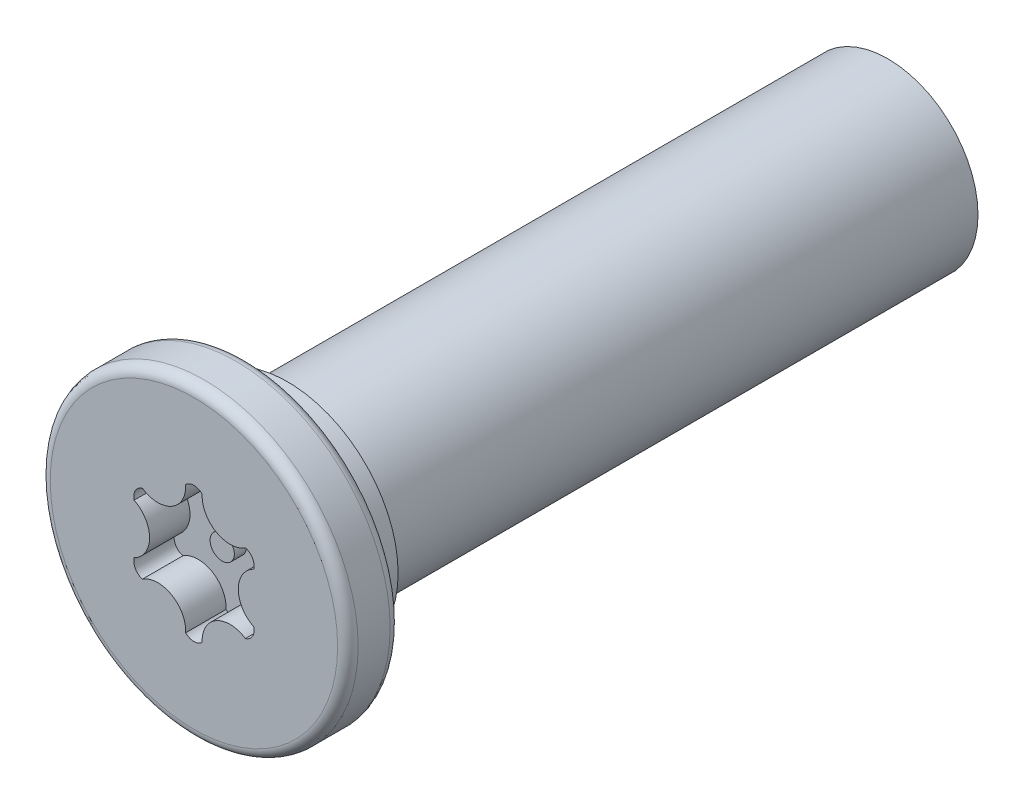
ISO-10303-21;
HEADER;
FILE_DESCRIPTION(('STEP AP214'),'2;1');
FILE_NAME('part.step','',(''),(''),'','','');
FILE_SCHEMA(('AUTOMOTIVE_DESIGN { 1 0 10303 214 1 1 1 1 }'));
ENDSEC;
DATA;
#1=APPLICATION_CONTEXT('core data for automotive mechanical design processes');
#2=APPLICATION_PROTOCOL_DEFINITION('international standard','automotive_design',2000,#1);
#3=PRODUCT_CONTEXT('',#1,'mechanical');
#4=PRODUCT('Part','Part','',(#3));
#5=PRODUCT_RELATED_PRODUCT_CATEGORY('part','',(#4));
#6=PRODUCT_DEFINITION_FORMATION('','',#4);
#7=PRODUCT_DEFINITION_CONTEXT('part definition',#1,'design');
#8=PRODUCT_DEFINITION('design','',#6,#7);
#9=PRODUCT_DEFINITION_SHAPE('','',#8);
#10=(LENGTH_UNIT() NAMED_UNIT(*) SI_UNIT(.MILLI.,.METRE.));
#11=(NAMED_UNIT(*) PLANE_ANGLE_UNIT() SI_UNIT($,.RADIAN.));
#12=(NAMED_UNIT(*) SI_UNIT($,.STERADIAN.) SOLID_ANGLE_UNIT());
#13=UNCERTAINTY_MEASURE_WITH_UNIT(LENGTH_MEASURE(1.E-05),#10,'distance_accuracy_value','');
#14=(GEOMETRIC_REPRESENTATION_CONTEXT(3) GLOBAL_UNCERTAINTY_ASSIGNED_CONTEXT((#13)) GLOBAL_UNIT_ASSIGNED_CONTEXT((#10,
#11,#12)) REPRESENTATION_CONTEXT('',''));
#15=CARTESIAN_POINT('',(0.,0.,0.));
#16=DIRECTION('',(0.,0.,1.));
#17=DIRECTION('',(1.,0.,0.));
#18=AXIS2_PLACEMENT_3D('',#15,#16,#17);
#19=CARTESIAN_POINT('',(0.,0.,0.));
#20=DIRECTION('',(0.,0.,1.));
#21=DIRECTION('',(1.,0.,0.));
#22=AXIS2_PLACEMENT_3D('',#19,#20,#21);
#23=PLANE('',#22);
#24=CARTESIAN_POINT('',(0.,0.,0.));
#25=DIRECTION('',(0.,0.,1.));
#26=DIRECTION('',(1.,0.,0.));
#27=AXIS2_PLACEMENT_3D('',#24,#25,#26);
#28=CIRCLE('',#27,3.55599999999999);
#29=CARTESIAN_POINT('',(3.55599999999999,0.,0.));
#30=VERTEX_POINT('',#29);
#31=EDGE_CURVE('E54',#30,#30,#28,.T.);
#32=ORIENTED_EDGE('',*,*,#31,.T.);
#33=EDGE_LOOP('',(#32));
#34=FACE_BOUND('',#33,.T.);
#35=CARTESIAN_POINT('',(0.893828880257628,1.54815703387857,0.));
#36=DIRECTION('',(0.,0.,1.));
#37=DIRECTION('',(1.,0.,0.));
#38=AXIS2_PLACEMENT_3D('',#35,#36,#37);
#39=CIRCLE('',#38,0.69);
#40=CARTESIAN_POINT('',(0.205060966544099,1.58937306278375,0.));
#41=VERTEX_POINT('',#40);
#42=CARTESIAN_POINT('',(1.27390696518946,0.972274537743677,0.));
#43=VERTEX_POINT('',#42);
#44=EDGE_CURVE('E181',#41,#43,#39,.T.);
#45=ORIENTED_EDGE('',*,*,#44,.T.);
#46=CARTESIAN_POINT('',(1.19884944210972,0.692156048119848,0.));
#47=DIRECTION('',(0.,0.,1.));
#48=DIRECTION('',(1.,0.,0.));
#49=AXIS2_PLACEMENT_3D('',#46,#47,#48);
#50=CIRCLE('',#49,0.29);
#51=CARTESIAN_POINT('',(1.47896793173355,0.617098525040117,0.));
#52=VERTEX_POINT('',#51);
#53=EDGE_CURVE('E61',#43,#52,#50,.F.);
#54=ORIENTED_EDGE('',*,*,#53,.T.);
#55=CARTESIAN_POINT('',(1.78765776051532,0.,0.));
#56=DIRECTION('',(0.,0.,1.));
#57=DIRECTION('',(1.,0.,0.));
#58=AXIS2_PLACEMENT_3D('',#55,#56,#57);
#59=CIRCLE('',#58,0.69);
#60=CARTESIAN_POINT('',(1.47896793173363,-0.617098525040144,0.));
#61=VERTEX_POINT('',#60);
#62=EDGE_CURVE('E111',#52,#61,#59,.T.);
#63=ORIENTED_EDGE('',*,*,#62,.T.);
#64=CARTESIAN_POINT('',(1.1988494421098,-0.692156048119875,0.));
#65=DIRECTION('',(0.,0.,1.));
#66=DIRECTION('',(1.,0.,0.));
#67=AXIS2_PLACEMENT_3D('',#64,#65,#66);
#68=CIRCLE('',#67,0.29);
#69=CARTESIAN_POINT('',(1.27390696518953,-0.972274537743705,0.));
#70=VERTEX_POINT('',#69);
#71=EDGE_CURVE('E216',#61,#70,#68,.F.);
#72=ORIENTED_EDGE('',*,*,#71,.T.);
#73=CARTESIAN_POINT('',(0.893828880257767,-1.54815703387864,0.));
#74=DIRECTION('',(0.,0.,1.));
#75=DIRECTION('',(1.,0.,0.));
#76=AXIS2_PLACEMENT_3D('',#73,#74,#75);
#77=CIRCLE('',#76,0.69);
#78=CARTESIAN_POINT('',(0.205060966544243,-1.5893730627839,0.));
#79=VERTEX_POINT('',#78);
#80=EDGE_CURVE('E160',#70,#79,#77,.T.);
#81=ORIENTED_EDGE('',*,*,#80,.T.);
#82=CARTESIAN_POINT('',(1.43067375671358E-13,-1.3843120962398,0.));
#83=DIRECTION('',(0.,0.,1.));
#84=DIRECTION('',(1.,0.,0.));
#85=AXIS2_PLACEMENT_3D('',#82,#83,#84);
#86=CIRCLE('',#85,0.29);
#87=CARTESIAN_POINT('',(-0.205060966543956,-1.5893730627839,0.));
#88=VERTEX_POINT('',#87);
#89=EDGE_CURVE('E210',#79,#88,#86,.F.);
#90=ORIENTED_EDGE('',*,*,#89,.T.);
#91=CARTESIAN_POINT('',(-0.893828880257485,-1.54815703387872,0.));
#92=DIRECTION('',(0.,0.,1.));
#93=DIRECTION('',(1.,0.,0.));
#94=AXIS2_PLACEMENT_3D('',#91,#92,#93);
#95=CIRCLE('',#94,0.69);
#96=CARTESIAN_POINT('',(-1.27390696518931,-0.97227453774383,0.));
#97=VERTEX_POINT('',#96);
#98=EDGE_CURVE('E206',#88,#97,#95,.T.);
#99=ORIENTED_EDGE('',*,*,#98,.T.);
#100=CARTESIAN_POINT('',(-1.19884944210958,-0.69215604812,0.));
#101=DIRECTION('',(0.,0.,1.));
#102=DIRECTION('',(1.,0.,0.));
#103=AXIS2_PLACEMENT_3D('',#100,#101,#102);
#104=CIRCLE('',#103,0.29);
#105=CARTESIAN_POINT('',(-1.47896793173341,-0.617098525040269,0.));
#106=VERTEX_POINT('',#105);
#107=EDGE_CURVE('E202',#97,#106,#104,.F.);
#108=ORIENTED_EDGE('',*,*,#107,.T.);
#109=CARTESIAN_POINT('',(-1.78765776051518,-1.56674837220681E-13,0.));
#110=DIRECTION('',(0.,0.,1.));
#111=DIRECTION('',(1.,0.,0.));
#112=AXIS2_PLACEMENT_3D('',#109,#110,#111);
#113=CIRCLE('',#112,0.69);
#114=CARTESIAN_POINT('',(-1.47896793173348,0.617098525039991,0.));
#115=VERTEX_POINT('',#114);
#116=EDGE_CURVE('E198',#106,#115,#113,.T.);
#117=ORIENTED_EDGE('',*,*,#116,.T.);
#118=CARTESIAN_POINT('',(-1.19884944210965,0.692156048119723,0.));
#119=DIRECTION('',(0.,0.,1.));
#120=DIRECTION('',(1.,0.,0.));
#121=AXIS2_PLACEMENT_3D('',#118,#119,#120);
#122=CIRCLE('',#121,0.29);
#123=CARTESIAN_POINT('',(-1.27390696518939,0.972274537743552,0.));
#124=VERTEX_POINT('',#123);
#125=EDGE_CURVE('E194',#115,#124,#122,.F.);
#126=ORIENTED_EDGE('',*,*,#125,.T.);
#127=CARTESIAN_POINT('',(-0.893828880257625,1.54815703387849,0.));
#128=DIRECTION('',(0.,0.,1.));
#129=DIRECTION('',(1.,0.,0.));
#130=AXIS2_PLACEMENT_3D('',#127,#128,#129);
#131=CIRCLE('',#130,0.690000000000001);
#132=CARTESIAN_POINT('',(-0.205060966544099,1.58937306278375,0.));
#133=VERTEX_POINT('',#132);
#134=EDGE_CURVE('E190',#124,#133,#131,.T.);
#135=ORIENTED_EDGE('',*,*,#134,.T.);
#136=CARTESIAN_POINT('',(0.,1.38431209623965,0.));
#137=DIRECTION('',(0.,0.,1.));
#138=DIRECTION('',(1.,0.,0.));
#139=AXIS2_PLACEMENT_3D('',#136,#137,#138);
#140=CIRCLE('',#139,0.29);
#141=EDGE_CURVE('E186',#133,#41,#140,.F.);
#142=ORIENTED_EDGE('',*,*,#141,.T.);
#143=EDGE_LOOP('',(#45,#54,#63,#72,#81,#90,#99,#108,#117,#126,#135,#142));
#144=FACE_BOUND('',#143,.T.);
#145=ADVANCED_FACE('F45',(#34,#144),#23,.T.);
#146=CARTESIAN_POINT('',(0.,0.,-1.3));
#147=DIRECTION('',(0.,0.,1.));
#148=DIRECTION('',(1.,0.,0.));
#149=AXIS2_PLACEMENT_3D('',#146,#147,#148);
#150=PLANE('',#149);
#151=CARTESIAN_POINT('',(0.,0.,-1.3));
#152=DIRECTION('',(0.,0.,1.));
#153=DIRECTION('',(1.,0.,0.));
#154=AXIS2_PLACEMENT_3D('',#151,#152,#153);
#155=CIRCLE('',#154,2.738000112);
#156=CARTESIAN_POINT('',(2.738000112,0.,-1.3));
#157=VERTEX_POINT('',#156);
#158=EDGE_CURVE('E11',#157,#157,#155,.F.);
#159=ORIENTED_EDGE('',*,*,#158,.F.);
#160=EDGE_LOOP('',(#159));
#161=FACE_BOUND('',#160,.T.);
#162=CARTESIAN_POINT('',(0.,0.,-1.3));
#163=DIRECTION('',(0.,0.,1.));
#164=DIRECTION('',(1.,0.,0.));
#165=AXIS2_PLACEMENT_3D('',#162,#163,#164);
#166=CIRCLE('',#165,3.55599999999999);
#167=CARTESIAN_POINT('',(3.55599999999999,0.,-1.3));
#168=VERTEX_POINT('',#167);
#169=EDGE_CURVE('E260',#168,#168,#166,.F.);
#170=ORIENTED_EDGE('',*,*,#169,.T.);
#171=EDGE_LOOP('',(#170));
#172=FACE_BOUND('',#171,.T.);
#173=ADVANCED_FACE('F283',(#161,#172),#150,.F.);
#174=CARTESIAN_POINT('',(0.,0.,-1.3));
#175=DIRECTION('',(0.,0.,1.));
#176=DIRECTION('',(1.,0.,0.));
#177=AXIS2_PLACEMENT_3D('',#174,#175,#176);
#178=CYLINDRICAL_SURFACE('',#177,3.80999999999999);
#179=CARTESIAN_POINT('',(0.,0.,-1.046));
#180=DIRECTION('',(0.,0.,1.));
#181=DIRECTION('',(1.,0.,0.));
#182=AXIS2_PLACEMENT_3D('',#179,#180,#181);
#183=CIRCLE('',#182,3.80999999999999);
#184=CARTESIAN_POINT('',(3.80999999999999,0.,-1.046));
#185=VERTEX_POINT('',#184);
#186=EDGE_CURVE('E256',#185,#185,#183,.T.);
#187=ORIENTED_EDGE('',*,*,#186,.T.);
#188=EDGE_LOOP('',(#187));
#189=FACE_BOUND('',#188,.T.);
#190=CARTESIAN_POINT('',(0.,0.,-0.254));
#191=DIRECTION('',(0.,0.,1.));
#192=DIRECTION('',(1.,0.,0.));
#193=AXIS2_PLACEMENT_3D('',#190,#191,#192);
#194=CIRCLE('',#193,3.80999999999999);
#195=CARTESIAN_POINT('',(3.80999999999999,0.,-0.254));
#196=VERTEX_POINT('',#195);
#197=EDGE_CURVE('E225',#196,#196,#194,.F.);
#198=ORIENTED_EDGE('',*,*,#197,.T.);
#199=EDGE_LOOP('',(#198));
#200=FACE_BOUND('',#199,.T.);
#201=ADVANCED_FACE('F289',(#189,#200),#178,.T.);
#202=CARTESIAN_POINT('',(1.19884944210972,0.692156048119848,-1.));
#203=DIRECTION('',(0.,0.,1.));
#204=DIRECTION('',(1.,0.,0.));
#205=AXIS2_PLACEMENT_3D('',#202,#203,#204);
#206=CYLINDRICAL_SURFACE('',#205,0.29);
#207=ORIENTED_EDGE('',*,*,#53,.F.);
#208=DIRECTION('',(0.,0.,1.));
#209=VECTOR('',#208,1.);
#210=CARTESIAN_POINT('',(1.27390696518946,0.972274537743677,-1.));
#211=LINE('',#210,#209);
#212=CARTESIAN_POINT('',(1.27390696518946,0.972274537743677,-1.));
#213=VERTEX_POINT('',#212);
#214=EDGE_CURVE('E178',#213,#43,#211,.T.);
#215=ORIENTED_EDGE('',*,*,#214,.F.);
#216=CARTESIAN_POINT('',(1.19884944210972,0.692156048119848,-1.));
#217=DIRECTION('',(0.,0.,1.));
#218=DIRECTION('',(1.,0.,0.));
#219=AXIS2_PLACEMENT_3D('',#216,#217,#218);
#220=CIRCLE('',#219,0.29);
#221=CARTESIAN_POINT('',(1.47896793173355,0.617098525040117,-1.));
#222=VERTEX_POINT('',#221);
#223=EDGE_CURVE('E221',#213,#222,#220,.F.);
#224=ORIENTED_EDGE('',*,*,#223,.T.);
#225=DIRECTION('',(0.,0.,1.));
#226=VECTOR('',#225,1.);
#227=CARTESIAN_POINT('',(1.47896793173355,0.617098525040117,-1.));
#228=LINE('',#227,#226);
#229=EDGE_CURVE('E222',#222,#52,#228,.T.);
#230=ORIENTED_EDGE('',*,*,#229,.T.);
#231=EDGE_LOOP('',(#207,#215,#224,#230));
#232=FACE_BOUND('',#231,.T.);
#233=ADVANCED_FACE('F294',(#232),#206,.F.);
#234=CARTESIAN_POINT('',(1.78765776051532,0.,-1.));
#235=DIRECTION('',(0.,0.,1.));
#236=DIRECTION('',(1.,0.,0.));
#237=AXIS2_PLACEMENT_3D('',#234,#235,#236);
#238=CYLINDRICAL_SURFACE('',#237,0.69);
#239=ORIENTED_EDGE('',*,*,#62,.F.);
#240=ORIENTED_EDGE('',*,*,#229,.F.);
#241=CARTESIAN_POINT('',(1.78765776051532,0.,-1.));
#242=DIRECTION('',(0.,0.,1.));
#243=DIRECTION('',(1.,0.,0.));
#244=AXIS2_PLACEMENT_3D('',#241,#242,#243);
#245=CIRCLE('',#244,0.69);
#246=CARTESIAN_POINT('',(1.47896793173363,-0.617098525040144,-1.));
#247=VERTEX_POINT('',#246);
#248=EDGE_CURVE('E70',#222,#247,#245,.T.);
#249=ORIENTED_EDGE('',*,*,#248,.T.);
#250=DIRECTION('',(0.,0.,1.));
#251=VECTOR('',#250,1.);
#252=CARTESIAN_POINT('',(1.47896793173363,-0.617098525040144,-1.));
#253=LINE('',#252,#251);
#254=EDGE_CURVE('E151',#247,#61,#253,.T.);
#255=ORIENTED_EDGE('',*,*,#254,.T.);
#256=EDGE_LOOP('',(#239,#240,#249,#255));
#257=FACE_BOUND('',#256,.T.);
#258=ADVANCED_FACE('F301',(#257),#238,.T.);
#259=CARTESIAN_POINT('',(1.1988494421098,-0.692156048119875,-1.));
#260=DIRECTION('',(0.,0.,1.));
#261=DIRECTION('',(1.,0.,0.));
#262=AXIS2_PLACEMENT_3D('',#259,#260,#261);
#263=CYLINDRICAL_SURFACE('',#262,0.29);
#264=ORIENTED_EDGE('',*,*,#71,.F.);
#265=ORIENTED_EDGE('',*,*,#254,.F.);
#266=CARTESIAN_POINT('',(1.1988494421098,-0.692156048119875,-1.));
#267=DIRECTION('',(0.,0.,1.));
#268=DIRECTION('',(1.,0.,0.));
#269=AXIS2_PLACEMENT_3D('',#266,#267,#268);
#270=CIRCLE('',#269,0.29);
#271=CARTESIAN_POINT('',(1.27390696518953,-0.972274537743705,-1.));
#272=VERTEX_POINT('',#271);
#273=EDGE_CURVE('E145',#247,#272,#270,.F.);
#274=ORIENTED_EDGE('',*,*,#273,.T.);
#275=DIRECTION('',(0.,0.,1.));
#276=VECTOR('',#275,1.);
#277=CARTESIAN_POINT('',(1.27390696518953,-0.972274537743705,-1.));
#278=LINE('',#277,#276);
#279=EDGE_CURVE('E149',#272,#70,#278,.T.);
#280=ORIENTED_EDGE('',*,*,#279,.T.);
#281=EDGE_LOOP('',(#264,#265,#274,#280));
#282=FACE_BOUND('',#281,.T.);
#283=ADVANCED_FACE('F148',(#282),#263,.F.);
#284=CARTESIAN_POINT('',(0.893828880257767,-1.54815703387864,-1.));
#285=DIRECTION('',(0.,0.,1.));
#286=DIRECTION('',(1.,0.,0.));
#287=AXIS2_PLACEMENT_3D('',#284,#285,#286);
#288=CYLINDRICAL_SURFACE('',#287,0.69);
#289=ORIENTED_EDGE('',*,*,#80,.F.);
#290=ORIENTED_EDGE('',*,*,#279,.F.);
#291=CARTESIAN_POINT('',(0.893828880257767,-1.54815703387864,-1.));
#292=DIRECTION('',(0.,0.,1.));
#293=DIRECTION('',(1.,0.,0.));
#294=AXIS2_PLACEMENT_3D('',#291,#292,#293);
#295=CIRCLE('',#294,0.69);
#296=CARTESIAN_POINT('',(0.205060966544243,-1.5893730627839,-1.));
#297=VERTEX_POINT('',#296);
#298=EDGE_CURVE('E154',#272,#297,#295,.T.);
#299=ORIENTED_EDGE('',*,*,#298,.T.);
#300=DIRECTION('',(0.,0.,1.));
#301=VECTOR('',#300,1.);
#302=CARTESIAN_POINT('',(0.205060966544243,-1.5893730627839,-1.));
#303=LINE('',#302,#301);
#304=EDGE_CURVE('E163',#297,#79,#303,.T.);
#305=ORIENTED_EDGE('',*,*,#304,.T.);
#306=EDGE_LOOP('',(#289,#290,#299,#305));
#307=FACE_BOUND('',#306,.T.);
#308=ADVANCED_FACE('F157',(#307),#288,.T.);
#309=CARTESIAN_POINT('',(1.43067375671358E-13,-1.3843120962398,-1.));
#310=DIRECTION('',(0.,0.,1.));
#311=DIRECTION('',(1.,0.,0.));
#312=AXIS2_PLACEMENT_3D('',#309,#310,#311);
#313=CYLINDRICAL_SURFACE('',#312,0.29);
#314=ORIENTED_EDGE('',*,*,#89,.F.);
#315=ORIENTED_EDGE('',*,*,#304,.F.);
#316=CARTESIAN_POINT('',(1.43067375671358E-13,-1.3843120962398,-1.));
#317=DIRECTION('',(0.,0.,1.));
#318=DIRECTION('',(1.,0.,0.));
#319=AXIS2_PLACEMENT_3D('',#316,#317,#318);
#320=CIRCLE('',#319,0.29);
#321=CARTESIAN_POINT('',(-0.205060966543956,-1.5893730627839,-1.));
#322=VERTEX_POINT('',#321);
#323=EDGE_CURVE('E168',#297,#322,#320,.F.);
#324=ORIENTED_EDGE('',*,*,#323,.T.);
#325=DIRECTION('',(0.,0.,1.));
#326=VECTOR('',#325,1.);
#327=CARTESIAN_POINT('',(-0.205060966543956,-1.5893730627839,-1.));
#328=LINE('',#327,#326);
#329=EDGE_CURVE('E230',#322,#88,#328,.T.);
#330=ORIENTED_EDGE('',*,*,#329,.T.);
#331=EDGE_LOOP('',(#314,#315,#324,#330));
#332=FACE_BOUND('',#331,.T.);
#333=ADVANCED_FACE('F318',(#332),#313,.F.);
#334=CARTESIAN_POINT('',(-0.893828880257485,-1.54815703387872,-1.));
#335=DIRECTION('',(0.,0.,1.));
#336=DIRECTION('',(1.,0.,0.));
#337=AXIS2_PLACEMENT_3D('',#334,#335,#336);
#338=CYLINDRICAL_SURFACE('',#337,0.69);
#339=ORIENTED_EDGE('',*,*,#98,.F.);
#340=ORIENTED_EDGE('',*,*,#329,.F.);
#341=CARTESIAN_POINT('',(-0.893828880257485,-1.54815703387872,-1.));
#342=DIRECTION('',(0.,0.,1.));
#343=DIRECTION('',(1.,0.,0.));
#344=AXIS2_PLACEMENT_3D('',#341,#342,#343);
#345=CIRCLE('',#344,0.69);
#346=CARTESIAN_POINT('',(-1.27390696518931,-0.97227453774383,-1.));
#347=VERTEX_POINT('',#346);
#348=EDGE_CURVE('E172',#322,#347,#345,.T.);
#349=ORIENTED_EDGE('',*,*,#348,.T.);
#350=DIRECTION('',(0.,0.,1.));
#351=VECTOR('',#350,1.);
#352=CARTESIAN_POINT('',(-1.27390696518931,-0.97227453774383,-1.));
#353=LINE('',#352,#351);
#354=EDGE_CURVE('E233',#347,#97,#353,.T.);
#355=ORIENTED_EDGE('',*,*,#354,.T.);
#356=EDGE_LOOP('',(#339,#340,#349,#355));
#357=FACE_BOUND('',#356,.T.);
#358=ADVANCED_FACE('F321',(#357),#338,.T.);
#359=CARTESIAN_POINT('',(-1.19884944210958,-0.69215604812,-1.));
#360=DIRECTION('',(0.,0.,1.));
#361=DIRECTION('',(1.,0.,0.));
#362=AXIS2_PLACEMENT_3D('',#359,#360,#361);
#363=CYLINDRICAL_SURFACE('',#362,0.29);
#364=ORIENTED_EDGE('',*,*,#107,.F.);
#365=ORIENTED_EDGE('',*,*,#354,.F.);
#366=CARTESIAN_POINT('',(-1.19884944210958,-0.69215604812,-1.));
#367=DIRECTION('',(0.,0.,1.));
#368=DIRECTION('',(1.,0.,0.));
#369=AXIS2_PLACEMENT_3D('',#366,#367,#368);
#370=CIRCLE('',#369,0.29);
#371=CARTESIAN_POINT('',(-1.47896793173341,-0.617098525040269,-1.));
#372=VERTEX_POINT('',#371);
#373=EDGE_CURVE('E374',#347,#372,#370,.F.);
#374=ORIENTED_EDGE('',*,*,#373,.T.);
#375=DIRECTION('',(0.,0.,1.));
#376=VECTOR('',#375,1.);
#377=CARTESIAN_POINT('',(-1.47896793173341,-0.617098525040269,-1.));
#378=LINE('',#377,#376);
#379=EDGE_CURVE('E236',#372,#106,#378,.T.);
#380=ORIENTED_EDGE('',*,*,#379,.T.);
#381=EDGE_LOOP('',(#364,#365,#374,#380));
#382=FACE_BOUND('',#381,.T.);
#383=ADVANCED_FACE('F325',(#382),#363,.F.);
#384=CARTESIAN_POINT('',(-1.78765776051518,-1.56674837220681E-13,-1.));
#385=DIRECTION('',(0.,0.,1.));
#386=DIRECTION('',(1.,0.,0.));
#387=AXIS2_PLACEMENT_3D('',#384,#385,#386);
#388=CYLINDRICAL_SURFACE('',#387,0.69);
#389=ORIENTED_EDGE('',*,*,#116,.F.);
#390=ORIENTED_EDGE('',*,*,#379,.F.);
#391=CARTESIAN_POINT('',(-1.78765776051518,-1.56674837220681E-13,-1.));
#392=DIRECTION('',(0.,0.,1.));
#393=DIRECTION('',(1.,0.,0.));
#394=AXIS2_PLACEMENT_3D('',#391,#392,#393);
#395=CIRCLE('',#394,0.69);
#396=CARTESIAN_POINT('',(-1.47896793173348,0.617098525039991,-1.));
#397=VERTEX_POINT('',#396);
#398=EDGE_CURVE('E371',#372,#397,#395,.T.);
#399=ORIENTED_EDGE('',*,*,#398,.T.);
#400=DIRECTION('',(0.,0.,1.));
#401=VECTOR('',#400,1.);
#402=CARTESIAN_POINT('',(-1.47896793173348,0.617098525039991,-1.));
#403=LINE('',#402,#401);
#404=EDGE_CURVE('E239',#397,#115,#403,.T.);
#405=ORIENTED_EDGE('',*,*,#404,.T.);
#406=EDGE_LOOP('',(#389,#390,#399,#405));
#407=FACE_BOUND('',#406,.T.);
#408=ADVANCED_FACE('F329',(#407),#388,.T.);
#409=CARTESIAN_POINT('',(-1.19884944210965,0.692156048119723,-1.));
#410=DIRECTION('',(0.,0.,1.));
#411=DIRECTION('',(1.,0.,0.));
#412=AXIS2_PLACEMENT_3D('',#409,#410,#411);
#413=CYLINDRICAL_SURFACE('',#412,0.29);
#414=ORIENTED_EDGE('',*,*,#125,.F.);
#415=ORIENTED_EDGE('',*,*,#404,.F.);
#416=CARTESIAN_POINT('',(-1.19884944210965,0.692156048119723,-1.));
#417=DIRECTION('',(0.,0.,1.));
#418=DIRECTION('',(1.,0.,0.));
#419=AXIS2_PLACEMENT_3D('',#416,#417,#418);
#420=CIRCLE('',#419,0.29);
#421=CARTESIAN_POINT('',(-1.27390696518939,0.972274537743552,-1.));
#422=VERTEX_POINT('',#421);
#423=EDGE_CURVE('E364',#397,#422,#420,.F.);
#424=ORIENTED_EDGE('',*,*,#423,.T.);
#425=DIRECTION('',(0.,0.,1.));
#426=VECTOR('',#425,1.);
#427=CARTESIAN_POINT('',(-1.27390696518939,0.972274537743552,-1.));
#428=LINE('',#427,#426);
#429=EDGE_CURVE('E242',#422,#124,#428,.T.);
#430=ORIENTED_EDGE('',*,*,#429,.T.);
#431=EDGE_LOOP('',(#414,#415,#424,#430));
#432=FACE_BOUND('',#431,.T.);
#433=ADVANCED_FACE('F333',(#432),#413,.F.);
#434=CARTESIAN_POINT('',(-0.893828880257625,1.54815703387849,-1.));
#435=DIRECTION('',(0.,0.,1.));
#436=DIRECTION('',(1.,0.,0.));
#437=AXIS2_PLACEMENT_3D('',#434,#435,#436);
#438=CYLINDRICAL_SURFACE('',#437,0.690000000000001);
#439=ORIENTED_EDGE('',*,*,#134,.F.);
#440=ORIENTED_EDGE('',*,*,#429,.F.);
#441=CARTESIAN_POINT('',(-0.893828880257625,1.54815703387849,-1.));
#442=DIRECTION('',(0.,0.,1.));
#443=DIRECTION('',(1.,0.,0.));
#444=AXIS2_PLACEMENT_3D('',#441,#442,#443);
#445=CIRCLE('',#444,0.690000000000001);
#446=CARTESIAN_POINT('',(-0.205060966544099,1.58937306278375,-1.));
#447=VERTEX_POINT('',#446);
#448=EDGE_CURVE('E360',#422,#447,#445,.T.);
#449=ORIENTED_EDGE('',*,*,#448,.T.);
#450=DIRECTION('',(0.,0.,1.));
#451=VECTOR('',#450,1.);
#452=CARTESIAN_POINT('',(-0.205060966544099,1.58937306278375,-1.));
#453=LINE('',#452,#451);
#454=EDGE_CURVE('E245',#447,#133,#453,.T.);
#455=ORIENTED_EDGE('',*,*,#454,.T.);
#456=EDGE_LOOP('',(#439,#440,#449,#455));
#457=FACE_BOUND('',#456,.T.);
#458=ADVANCED_FACE('F337',(#457),#438,.T.);
#459=CARTESIAN_POINT('',(0.,1.38431209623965,-1.));
#460=DIRECTION('',(0.,0.,1.));
#461=DIRECTION('',(1.,0.,0.));
#462=AXIS2_PLACEMENT_3D('',#459,#460,#461);
#463=CYLINDRICAL_SURFACE('',#462,0.29);
#464=ORIENTED_EDGE('',*,*,#141,.F.);
#465=ORIENTED_EDGE('',*,*,#454,.F.);
#466=CARTESIAN_POINT('',(0.,1.38431209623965,-1.));
#467=DIRECTION('',(0.,0.,1.));
#468=DIRECTION('',(1.,0.,0.));
#469=AXIS2_PLACEMENT_3D('',#466,#467,#468);
#470=CIRCLE('',#469,0.29);
#471=CARTESIAN_POINT('',(0.205060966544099,1.58937306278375,-1.));
#472=VERTEX_POINT('',#471);
#473=EDGE_CURVE('E357',#447,#472,#470,.F.);
#474=ORIENTED_EDGE('',*,*,#473,.T.);
#475=DIRECTION('',(0.,0.,1.));
#476=VECTOR('',#475,1.);
#477=CARTESIAN_POINT('',(0.205060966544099,1.58937306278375,-1.));
#478=LINE('',#477,#476);
#479=EDGE_CURVE('E248',#472,#41,#478,.T.);
#480=ORIENTED_EDGE('',*,*,#479,.T.);
#481=EDGE_LOOP('',(#464,#465,#474,#480));
#482=FACE_BOUND('',#481,.T.);
#483=ADVANCED_FACE('F341',(#482),#463,.F.);
#484=CARTESIAN_POINT('',(0.893828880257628,1.54815703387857,-1.));
#485=DIRECTION('',(0.,0.,1.));
#486=DIRECTION('',(1.,0.,0.));
#487=AXIS2_PLACEMENT_3D('',#484,#485,#486);
#488=CYLINDRICAL_SURFACE('',#487,0.69);
#489=ORIENTED_EDGE('',*,*,#44,.F.);
#490=ORIENTED_EDGE('',*,*,#479,.F.);
#491=CARTESIAN_POINT('',(0.893828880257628,1.54815703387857,-1.));
#492=DIRECTION('',(0.,0.,1.));
#493=DIRECTION('',(1.,0.,0.));
#494=AXIS2_PLACEMENT_3D('',#491,#492,#493);
#495=CIRCLE('',#494,0.69);
#496=EDGE_CURVE('E118',#472,#213,#495,.T.);
#497=ORIENTED_EDGE('',*,*,#496,.T.);
#498=ORIENTED_EDGE('',*,*,#214,.T.);
#499=EDGE_LOOP('',(#489,#490,#497,#498));
#500=FACE_BOUND('',#499,.T.);
#501=ADVANCED_FACE('F344',(#500),#488,.T.);
#502=CARTESIAN_POINT('',(0.,0.,-1.));
#503=DIRECTION('',(0.,0.,1.));
#504=DIRECTION('',(1.,0.,0.));
#505=AXIS2_PLACEMENT_3D('',#502,#503,#504);
#506=PLANE('',#505);
#507=CARTESIAN_POINT('',(0.,0.,-1.));
#508=DIRECTION('',(0.,0.,1.));
#509=DIRECTION('',(1.,0.,0.));
#510=AXIS2_PLACEMENT_3D('',#507,#508,#509);
#511=CIRCLE('',#510,0.3);
#512=CARTESIAN_POINT('',(0.3,0.,-1.));
#513=VERTEX_POINT('',#512);
#514=EDGE_CURVE('E396',#513,#513,#511,.T.);
#515=ORIENTED_EDGE('',*,*,#514,.F.);
#516=EDGE_LOOP('',(#515));
#517=FACE_BOUND('',#516,.T.);
#518=ORIENTED_EDGE('',*,*,#223,.F.);
#519=ORIENTED_EDGE('',*,*,#496,.F.);
#520=ORIENTED_EDGE('',*,*,#473,.F.);
#521=ORIENTED_EDGE('',*,*,#448,.F.);
#522=ORIENTED_EDGE('',*,*,#423,.F.);
#523=ORIENTED_EDGE('',*,*,#398,.F.);
#524=ORIENTED_EDGE('',*,*,#373,.F.);
#525=ORIENTED_EDGE('',*,*,#348,.F.);
#526=ORIENTED_EDGE('',*,*,#323,.F.);
#527=ORIENTED_EDGE('',*,*,#298,.F.);
#528=ORIENTED_EDGE('',*,*,#273,.F.);
#529=ORIENTED_EDGE('',*,*,#248,.F.);
#530=EDGE_LOOP('',(#518,#519,#520,#521,#522,#523,#524,#525,#526,#527,#528,#529));
#531=FACE_BOUND('',#530,.T.);
#532=ADVANCED_FACE('F166',(#517,#531),#506,.T.);
#533=CARTESIAN_POINT('',(0.,0.,-1.046));
#534=DIRECTION('',(0.,0.,1.));
#535=DIRECTION('',(1.,0.,0.));
#536=AXIS2_PLACEMENT_3D('',#533,#534,#535);
#537=TOROIDAL_SURFACE('',#536,3.55599999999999,0.254);
#538=ORIENTED_EDGE('',*,*,#169,.F.);
#539=EDGE_LOOP('',(#538));
#540=FACE_BOUND('',#539,.T.);
#541=ORIENTED_EDGE('',*,*,#186,.F.);
#542=EDGE_LOOP('',(#541));
#543=FACE_BOUND('',#542,.T.);
#544=ADVANCED_FACE('F271',(#540,#543),#537,.T.);
#545=CARTESIAN_POINT('',(0.,0.,-0.254));
#546=DIRECTION('',(0.,0.,1.));
#547=DIRECTION('',(1.,0.,0.));
#548=AXIS2_PLACEMENT_3D('',#545,#546,#547);
#549=TOROIDAL_SURFACE('',#548,3.55599999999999,0.254);
#550=ORIENTED_EDGE('',*,*,#197,.F.);
#551=EDGE_LOOP('',(#550));
#552=FACE_BOUND('',#551,.T.);
#553=ORIENTED_EDGE('',*,*,#31,.F.);
#554=EDGE_LOOP('',(#553));
#555=FACE_BOUND('',#554,.T.);
#556=ADVANCED_FACE('F47',(#552,#555),#549,.T.);
#557=CARTESIAN_POINT('',(0.,0.,-2.316));
#558=DIRECTION('',(0.,0.,-1.));
#559=DIRECTION('',(-1.,0.,0.));
#560=AXIS2_PLACEMENT_3D('',#557,#558,#559);
#561=PLANE('',#560);
#562=CARTESIAN_POINT('',(0.,0.,-2.316));
#563=DIRECTION('',(0.,0.,-1.));
#564=DIRECTION('',(-1.,0.,0.));
#565=AXIS2_PLACEMENT_3D('',#562,#563,#564);
#566=CIRCLE('',#565,2.738000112);
#567=CARTESIAN_POINT('',(-2.738000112,0.,-2.316));
#568=VERTEX_POINT('',#567);
#569=EDGE_CURVE('E182',#568,#568,#566,.T.);
#570=ORIENTED_EDGE('',*,*,#569,.T.);
#571=EDGE_LOOP('',(#570));
#572=FACE_BOUND('',#571,.T.);
#573=CARTESIAN_POINT('',(0.,0.,-2.316));
#574=DIRECTION('',(0.,0.,-1.));
#575=DIRECTION('',(-1.,0.,0.));
#576=AXIS2_PLACEMENT_3D('',#573,#574,#575);
#577=CIRCLE('',#576,2.230000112);
#578=CARTESIAN_POINT('',(-2.230000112,0.,-2.316));
#579=VERTEX_POINT('',#578);
#580=EDGE_CURVE('E400',#579,#579,#577,.T.);
#581=ORIENTED_EDGE('',*,*,#580,.F.);
#582=EDGE_LOOP('',(#581));
#583=FACE_BOUND('',#582,.T.);
#584=ADVANCED_FACE('F270',(#572,#583),#561,.T.);
#585=CARTESIAN_POINT('',(0.,0.,-2.316));
#586=DIRECTION('',(0.,0.,1.));
#587=DIRECTION('',(1.,0.,0.));
#588=AXIS2_PLACEMENT_3D('',#585,#586,#587);
#589=CYLINDRICAL_SURFACE('',#588,2.738000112);
#590=ORIENTED_EDGE('',*,*,#569,.F.);
#591=EDGE_LOOP('',(#590));
#592=FACE_BOUND('',#591,.T.);
#593=ORIENTED_EDGE('',*,*,#158,.T.);
#594=EDGE_LOOP('',(#593));
#595=FACE_BOUND('',#594,.T.);
#596=ADVANCED_FACE('F277',(#592,#595),#589,.T.);
#597=CARTESIAN_POINT('',(0.,0.,-0.7));
#598=DIRECTION('',(0.,0.,-1.));
#599=DIRECTION('',(-1.,0.,0.));
#600=AXIS2_PLACEMENT_3D('',#597,#598,#599);
#601=CYLINDRICAL_SURFACE('',#600,0.3);
#602=CARTESIAN_POINT('',(0.,0.,-0.7));
#603=DIRECTION('',(0.,0.,1.));
#604=DIRECTION('',(1.,0.,0.));
#605=AXIS2_PLACEMENT_3D('',#602,#603,#604);
#606=CIRCLE('',#605,0.3);
#607=CARTESIAN_POINT('',(0.3,0.,-0.7));
#608=VERTEX_POINT('',#607);
#609=EDGE_CURVE('E395',#608,#608,#606,.T.);
#610=ORIENTED_EDGE('',*,*,#609,.F.);
#611=EDGE_LOOP('',(#610));
#612=FACE_BOUND('',#611,.T.);
#613=ORIENTED_EDGE('',*,*,#514,.T.);
#614=EDGE_LOOP('',(#613));
#615=FACE_BOUND('',#614,.T.);
#616=ADVANCED_FACE('F424',(#612,#615),#601,.T.);
#617=CARTESIAN_POINT('',(0.,0.,-0.7));
#618=DIRECTION('',(0.,0.,1.));
#619=DIRECTION('',(1.,0.,0.));
#620=AXIS2_PLACEMENT_3D('',#617,#618,#619);
#621=PLANE('',#620);
#622=ORIENTED_EDGE('',*,*,#609,.T.);
#623=EDGE_LOOP('',(#622));
#624=FACE_BOUND('',#623,.T.);
#625=ADVANCED_FACE('F416',(#624),#621,.T.);
#626=CARTESIAN_POINT('',(0.,0.,-17.175));
#627=DIRECTION('',(0.,0.,1.));
#628=DIRECTION('',(1.,0.,0.));
#629=AXIS2_PLACEMENT_3D('',#626,#627,#628);
#630=CYLINDRICAL_SURFACE('',#629,2.230000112);
#631=ORIENTED_EDGE('',*,*,#580,.T.);
#632=EDGE_LOOP('',(#631));
#633=FACE_BOUND('',#632,.T.);
#634=CARTESIAN_POINT('',(0.,0.,-17.175));
#635=DIRECTION('',(0.,0.,-1.));
#636=DIRECTION('',(-1.,0.,0.));
#637=AXIS2_PLACEMENT_3D('',#634,#635,#636);
#638=CIRCLE('',#637,2.230000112);
#639=CARTESIAN_POINT('',(-2.230000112,0.,-17.175));
#640=VERTEX_POINT('',#639);
#641=EDGE_CURVE('E407',#640,#640,#638,.T.);
#642=ORIENTED_EDGE('',*,*,#641,.F.);
#643=EDGE_LOOP('',(#642));
#644=FACE_BOUND('',#643,.T.);
#645=ADVANCED_FACE('F414',(#633,#644),#630,.T.);
#646=CARTESIAN_POINT('',(0.,0.,-17.175));
#647=DIRECTION('',(0.,0.,-1.));
#648=DIRECTION('',(-1.,0.,0.));
#649=AXIS2_PLACEMENT_3D('',#646,#647,#648);
#650=PLANE('',#649);
#651=ORIENTED_EDGE('',*,*,#641,.T.);
#652=EDGE_LOOP('',(#651));
#653=FACE_BOUND('',#652,.T.);
#654=ADVANCED_FACE('F412',(#653),#650,.T.);
#655=CLOSED_SHELL('',(#145,#173,#201,#233,#258,#283,#308,#333,#358,#383,#408,#433,#458,#483,
#501,#532,#544,#556,#584,#596,#616,#625,#645,#654));
#656=MANIFOLD_SOLID_BREP('B2',#655);
#657=ADVANCED_BREP_SHAPE_REPRESENTATION('',(#18,#656),#14);
#658=SHAPE_DEFINITION_REPRESENTATION(#9,#657);
ENDSEC;
END-ISO-10303-21;
